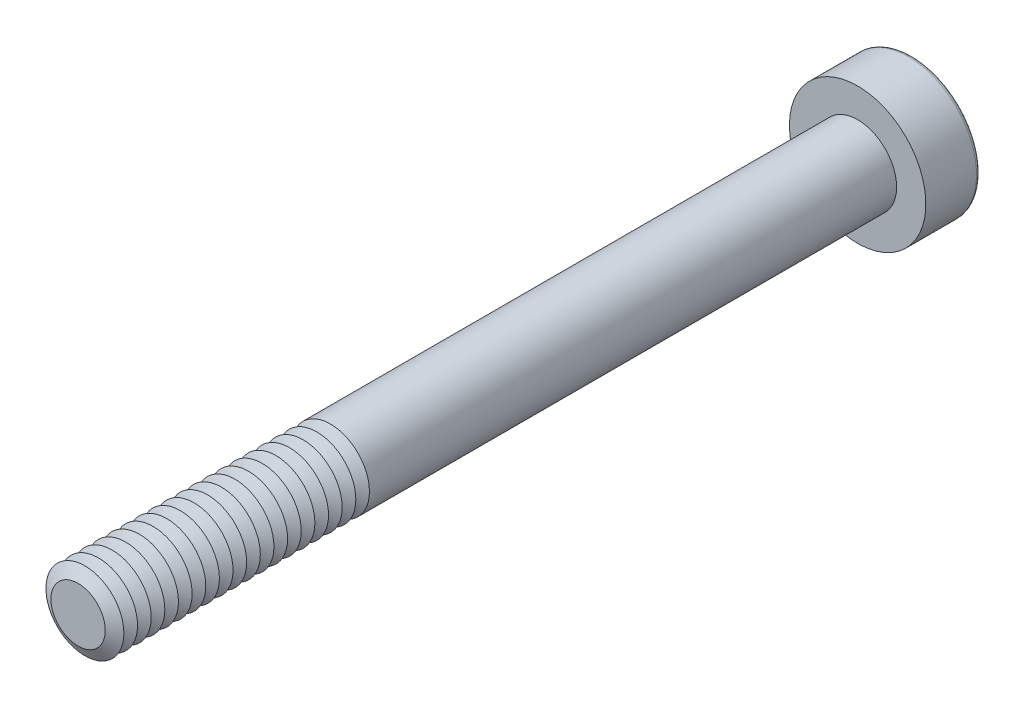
from build123d import *

# Parameters (mm, degrees)
SKETCH1_R           = 2
BOSS_EXTRUDE1_DEPTH = 40
SKETCH2_R           = 3.5
BOSS_EXTRUDE2_DEPTH = 2.8
CUT_EXTRUDE1_DEPTH  = 1.875
FILLET1_R           = 0.2
LPATTERN1_COUNT     = 19
LPATTERN1_PITCH     = 0.7


with BuildPart() as part:
    # Sketch1 → Boss-Extrude1 (new body)
    with BuildSketch(Plane.XY):
        Circle(SKETCH1_R)
    extrude(amount=BOSS_EXTRUDE1_DEPTH)

    # Sketch2 → Boss-Extrude2 (add)
    with BuildSketch(Plane(origin=(0, 0, 0), x_dir=(-1, 0, 0), z_dir=(0, 0, -1))):
        Circle(SKETCH2_R)
    extrude(amount=BOSS_EXTRUDE2_DEPTH)

    # Sketch3 → Cut-Extrude1 (cut)
    with BuildSketch(Plane(origin=(0, 0, -2.8), x_dir=(-1, 0, 0), z_dir=(0, 0, -1))):
        Polygon((-0.721687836, 1.25), (-1.443375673, 0), (-0.721687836, -1.25), (0.721687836, -1.25), (1.443375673, 0), (0.721687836, 1.25), align=None)
    extrude(amount=-CUT_EXTRUDE1_DEPTH, mode=Mode.SUBTRACT)

    # Fillet1
    fillet1_edges = [part.edges().sort_by_distance(p)[0] for p in [
        (3.5, 0, -2.8),
    ]]
    fillet(fillet1_edges, radius=FILLET1_R)

    # Cut-Extrude2 cone 1 section (on through the dimple's axis) → Cut-Extrude2 (revolve, cut)
    with BuildSketch(Plane(origin=(0, 0, -0.925), x_dir=(0, 1, 0), z_dir=(1, 0, 0))):
        Polygon((0, 0), (1.25, 0), (0, 0.721687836), align=None)
    revolve(axis=Axis((0, 0, -0.925), (0, 0, 1)), mode=Mode.SUBTRACT)

    # Cut-Extrude3 cone 1 section (on through the dimple's axis) → Cut-Extrude3 (revolve, cut)
    with BuildSketch(Plane(origin=(0, 0, -2.8), x_dir=(0, 1, 0), z_dir=(1, 0, 0))):
        Polygon((0, 0), (1.443375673, 0), (0, 0.386751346), align=None)
    revolve(axis=Axis((0, 0, -2.8), (0, 0, 1)), mode=Mode.SUBTRACT)

    # Sketch7 → Cut-Revolve1 (revolve, cut)
    with BuildSketch(Plane(origin=(0, 0, 0), x_dir=(0, 0, -1), z_dir=(1, 0, 0)), mode=Mode.PRIVATE) as cut_revolve1_sk:
        Polygon((-40, 1.393782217), (-39.65, 2), (-40.35, 2), align=None)
    cut_revolve1 = revolve(cut_revolve1_sk.sketch.rotate(Axis((0, 0, 40), (0, 0, -1)), 90), axis=Axis((0, 0, 40), (0, 0, -1)), mode=Mode.SUBTRACT)

    # LPattern1: Cut-Revolve1 ×19
    with Locations(*[(0, 0, -i * LPATTERN1_PITCH) for i in range(1, LPATTERN1_COUNT)]):
        add(cut_revolve1, mode=Mode.SUBTRACT)


solid = part.part
